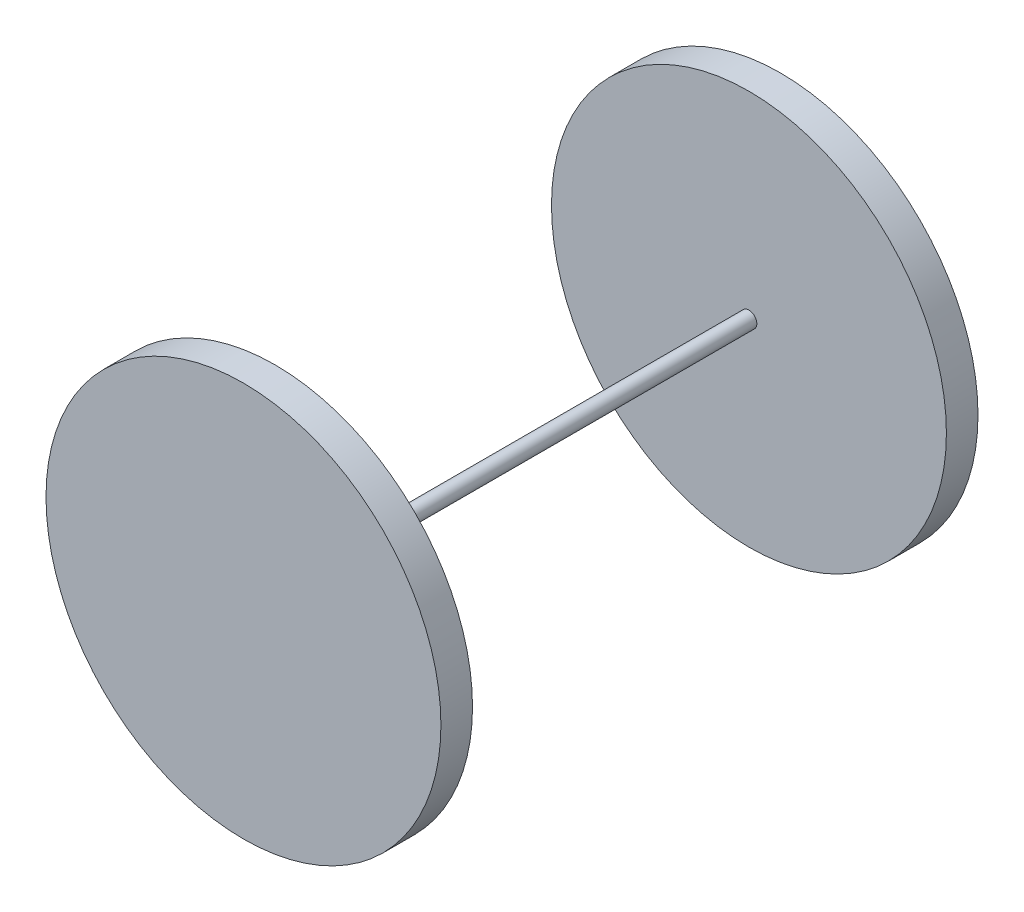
ISO-10303-21;
HEADER;
FILE_DESCRIPTION(('STEP AP214'),'2;1');
FILE_NAME('part.step','',(''),(''),'','','');
FILE_SCHEMA(('AUTOMOTIVE_DESIGN { 1 0 10303 214 1 1 1 1 }'));
ENDSEC;
DATA;
#1=APPLICATION_CONTEXT('core data for automotive mechanical design processes');
#2=APPLICATION_PROTOCOL_DEFINITION('international standard','automotive_design',2000,#1);
#3=PRODUCT_CONTEXT('',#1,'mechanical');
#4=PRODUCT('Part','Part','',(#3));
#5=PRODUCT_RELATED_PRODUCT_CATEGORY('part','',(#4));
#6=PRODUCT_DEFINITION_FORMATION('','',#4);
#7=PRODUCT_DEFINITION_CONTEXT('part definition',#1,'design');
#8=PRODUCT_DEFINITION('design','',#6,#7);
#9=PRODUCT_DEFINITION_SHAPE('','',#8);
#10=(LENGTH_UNIT() NAMED_UNIT(*) SI_UNIT(.MILLI.,.METRE.));
#11=(NAMED_UNIT(*) PLANE_ANGLE_UNIT() SI_UNIT($,.RADIAN.));
#12=(NAMED_UNIT(*) SI_UNIT($,.STERADIAN.) SOLID_ANGLE_UNIT());
#13=UNCERTAINTY_MEASURE_WITH_UNIT(LENGTH_MEASURE(1.E-05),#10,'distance_accuracy_value','');
#14=(GEOMETRIC_REPRESENTATION_CONTEXT(3) GLOBAL_UNCERTAINTY_ASSIGNED_CONTEXT((#13)) GLOBAL_UNIT_ASSIGNED_CONTEXT((#10,
#11,#12)) REPRESENTATION_CONTEXT('',''));
#15=CARTESIAN_POINT('',(0.,0.,0.));
#16=DIRECTION('',(0.,0.,1.));
#17=DIRECTION('',(1.,0.,0.));
#18=AXIS2_PLACEMENT_3D('',#15,#16,#17);
#19=CARTESIAN_POINT('',(0.,0.,20.));
#20=DIRECTION('',(0.,0.,1.));
#21=DIRECTION('',(1.,0.,0.));
#22=AXIS2_PLACEMENT_3D('',#19,#20,#21);
#23=PLANE('',#22);
#24=CARTESIAN_POINT('',(0.,0.,20.));
#25=DIRECTION('',(0.,0.,1.));
#26=DIRECTION('',(1.,0.,0.));
#27=AXIS2_PLACEMENT_3D('',#24,#25,#26);
#28=CIRCLE('',#27,125.);
#29=CARTESIAN_POINT('',(125.,0.,20.));
#30=VERTEX_POINT('',#29);
#31=EDGE_CURVE('E10',#30,#30,#28,.T.);
#32=ORIENTED_EDGE('',*,*,#31,.T.);
#33=EDGE_LOOP('',(#32));
#34=FACE_BOUND('',#33,.T.);
#35=CARTESIAN_POINT('',(0.,0.,20.));
#36=DIRECTION('',(0.,0.,1.));
#37=DIRECTION('',(1.,0.,0.));
#38=AXIS2_PLACEMENT_3D('',#35,#36,#37);
#39=CIRCLE('',#38,5.);
#40=CARTESIAN_POINT('',(5.,0.,20.));
#41=VERTEX_POINT('',#40);
#42=EDGE_CURVE('E49',#41,#41,#39,.T.);
#43=ORIENTED_EDGE('',*,*,#42,.F.);
#44=EDGE_LOOP('',(#43));
#45=FACE_BOUND('',#44,.T.);
#46=ADVANCED_FACE('F36',(#34,#45),#23,.T.);
#47=CARTESIAN_POINT('',(0.,0.,20.));
#48=DIRECTION('',(0.,0.,-1.));
#49=DIRECTION('',(-1.,0.,0.));
#50=AXIS2_PLACEMENT_3D('',#47,#48,#49);
#51=CYLINDRICAL_SURFACE('',#50,125.);
#52=ORIENTED_EDGE('',*,*,#31,.F.);
#53=EDGE_LOOP('',(#52));
#54=FACE_BOUND('',#53,.T.);
#55=CARTESIAN_POINT('',(0.,0.,0.));
#56=DIRECTION('',(0.,0.,1.));
#57=DIRECTION('',(1.,0.,0.));
#58=AXIS2_PLACEMENT_3D('',#55,#56,#57);
#59=CIRCLE('',#58,125.);
#60=CARTESIAN_POINT('',(125.,0.,0.));
#61=VERTEX_POINT('',#60);
#62=EDGE_CURVE('E40',#61,#61,#59,.T.);
#63=ORIENTED_EDGE('',*,*,#62,.T.);
#64=EDGE_LOOP('',(#63));
#65=FACE_BOUND('',#64,.T.);
#66=ADVANCED_FACE('F38',(#54,#65),#51,.T.);
#67=CARTESIAN_POINT('',(0.,0.,0.));
#68=DIRECTION('',(0.,0.,1.));
#69=DIRECTION('',(1.,0.,0.));
#70=AXIS2_PLACEMENT_3D('',#67,#68,#69);
#71=PLANE('',#70);
#72=ORIENTED_EDGE('',*,*,#62,.F.);
#73=EDGE_LOOP('',(#72));
#74=FACE_BOUND('',#73,.T.);
#75=ADVANCED_FACE('F78',(#74),#71,.F.);
#76=CARTESIAN_POINT('',(0.,0.,320.));
#77=DIRECTION('',(0.,0.,-1.));
#78=DIRECTION('',(-1.,0.,0.));
#79=AXIS2_PLACEMENT_3D('',#76,#77,#78);
#80=CYLINDRICAL_SURFACE('',#79,5.);
#81=CARTESIAN_POINT('',(0.,0.,320.));
#82=DIRECTION('',(0.,0.,1.));
#83=DIRECTION('',(1.,0.,0.));
#84=AXIS2_PLACEMENT_3D('',#81,#82,#83);
#85=CIRCLE('',#84,5.);
#86=CARTESIAN_POINT('',(5.,0.,320.));
#87=VERTEX_POINT('',#86);
#88=EDGE_CURVE('E47',#87,#87,#85,.T.);
#89=ORIENTED_EDGE('',*,*,#88,.F.);
#90=EDGE_LOOP('',(#89));
#91=FACE_BOUND('',#90,.T.);
#92=ORIENTED_EDGE('',*,*,#42,.T.);
#93=EDGE_LOOP('',(#92));
#94=FACE_BOUND('',#93,.T.);
#95=ADVANCED_FACE('F72',(#91,#94),#80,.T.);
#96=CARTESIAN_POINT('',(0.,0.,320.));
#97=DIRECTION('',(0.,0.,1.));
#98=DIRECTION('',(1.,0.,0.));
#99=AXIS2_PLACEMENT_3D('',#96,#97,#98);
#100=PLANE('',#99);
#101=CARTESIAN_POINT('',(0.,0.,320.));
#102=DIRECTION('',(0.,0.,1.));
#103=DIRECTION('',(1.,0.,0.));
#104=AXIS2_PLACEMENT_3D('',#101,#102,#103);
#105=CIRCLE('',#104,125.);
#106=CARTESIAN_POINT('',(125.,0.,320.));
#107=VERTEX_POINT('',#106);
#108=EDGE_CURVE('E55',#107,#107,#105,.T.);
#109=ORIENTED_EDGE('',*,*,#108,.F.);
#110=EDGE_LOOP('',(#109));
#111=FACE_BOUND('',#110,.T.);
#112=ORIENTED_EDGE('',*,*,#88,.T.);
#113=EDGE_LOOP('',(#112));
#114=FACE_BOUND('',#113,.T.);
#115=ADVANCED_FACE('F66',(#111,#114),#100,.F.);
#116=CARTESIAN_POINT('',(0.,0.,340.));
#117=DIRECTION('',(0.,0.,-1.));
#118=DIRECTION('',(-1.,0.,0.));
#119=AXIS2_PLACEMENT_3D('',#116,#117,#118);
#120=CYLINDRICAL_SURFACE('',#119,125.);
#121=CARTESIAN_POINT('',(0.,0.,340.));
#122=DIRECTION('',(0.,0.,1.));
#123=DIRECTION('',(1.,0.,0.));
#124=AXIS2_PLACEMENT_3D('',#121,#122,#123);
#125=CIRCLE('',#124,125.);
#126=CARTESIAN_POINT('',(125.,0.,340.));
#127=VERTEX_POINT('',#126);
#128=EDGE_CURVE('E52',#127,#127,#125,.T.);
#129=ORIENTED_EDGE('',*,*,#128,.F.);
#130=EDGE_LOOP('',(#129));
#131=FACE_BOUND('',#130,.T.);
#132=ORIENTED_EDGE('',*,*,#108,.T.);
#133=EDGE_LOOP('',(#132));
#134=FACE_BOUND('',#133,.T.);
#135=ADVANCED_FACE('F63',(#131,#134),#120,.T.);
#136=CARTESIAN_POINT('',(0.,0.,340.));
#137=DIRECTION('',(0.,0.,1.));
#138=DIRECTION('',(1.,0.,0.));
#139=AXIS2_PLACEMENT_3D('',#136,#137,#138);
#140=PLANE('',#139);
#141=ORIENTED_EDGE('',*,*,#128,.T.);
#142=EDGE_LOOP('',(#141));
#143=FACE_BOUND('',#142,.T.);
#144=ADVANCED_FACE('F61',(#143),#140,.T.);
#145=CLOSED_SHELL('',(#46,#66,#75,#95,#115,#135,#144));
#146=MANIFOLD_SOLID_BREP('B2',#145);
#147=ADVANCED_BREP_SHAPE_REPRESENTATION('',(#18,#146),#14);
#148=SHAPE_DEFINITION_REPRESENTATION(#9,#147);
ENDSEC;
END-ISO-10303-21;
